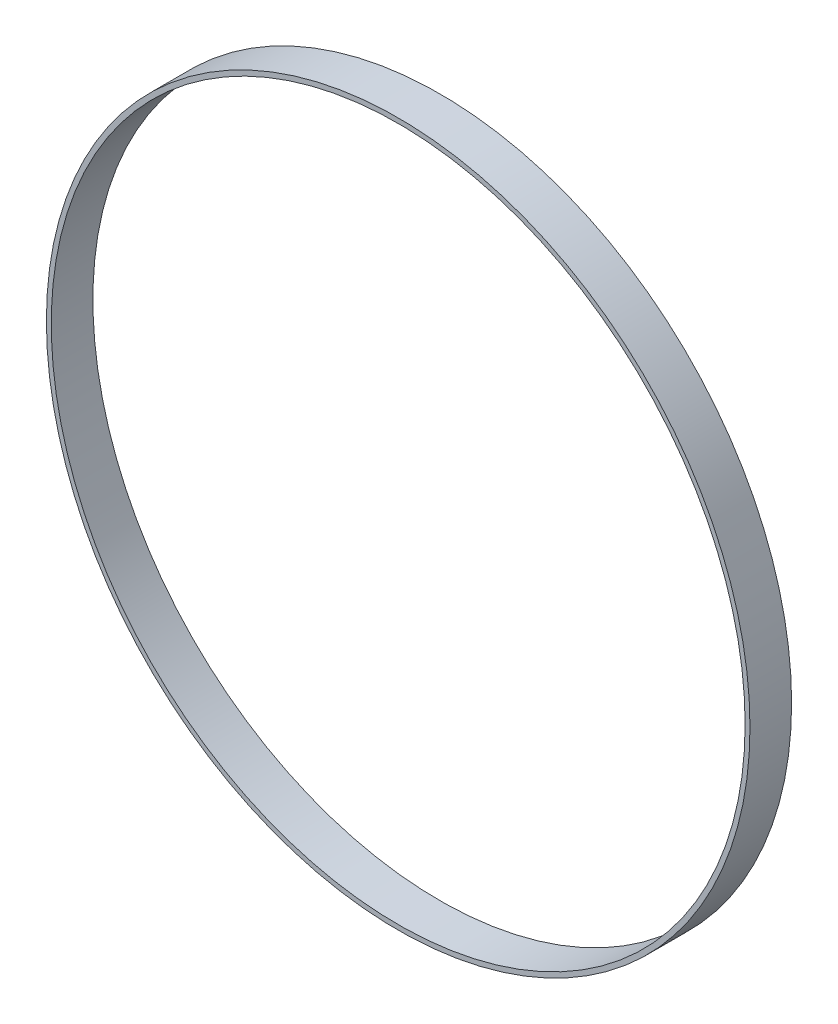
from build123d import *

# Parameters (mm, degrees)
ESQUISSE1_R      = 50.7
ESQUISSE1_R_2    = 50
EXTRUSION1_DEPTH = 6


with BuildPart() as part:
    # Esquisse1 → Extrusion1 (new body)
    with BuildSketch(Plane.XY):
        Circle(ESQUISSE1_R)
        Circle(ESQUISSE1_R_2, mode=Mode.SUBTRACT)
    extrude(amount=EXTRUSION1_DEPTH)


solid = part.part
